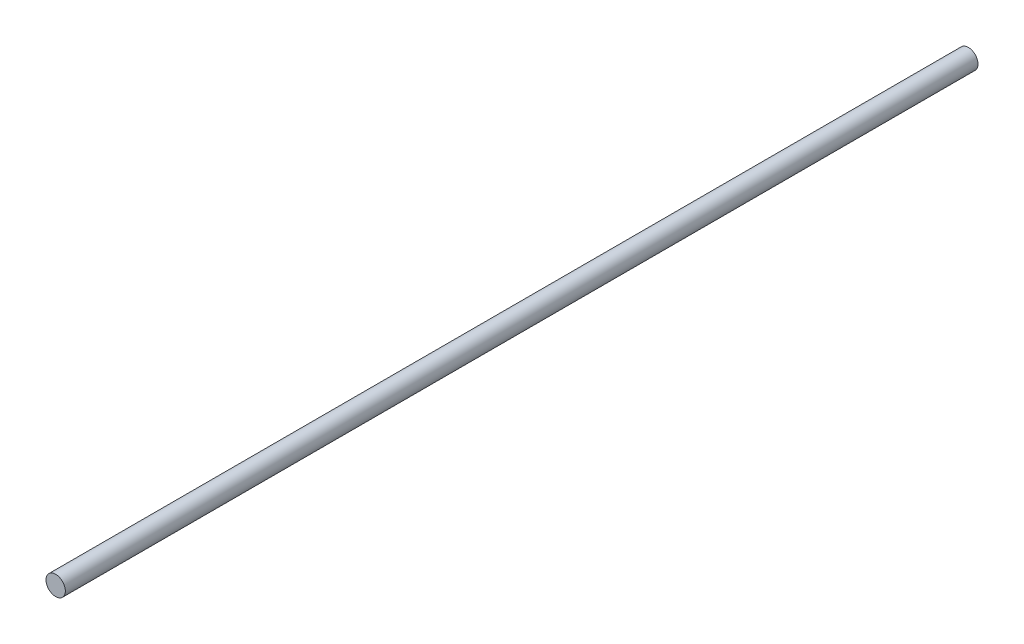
from build123d import *

# Parameters (mm, degrees)
SKETCH_1_R      = 4
EXTRUDE_1_DEPTH = 377


with BuildPart() as part:
    # Sketch 1 → Extrude 1 (new body)
    with BuildSketch(Plane.XY):
        Circle(SKETCH_1_R)
    extrude(amount=EXTRUDE_1_DEPTH)


solid = part.part
